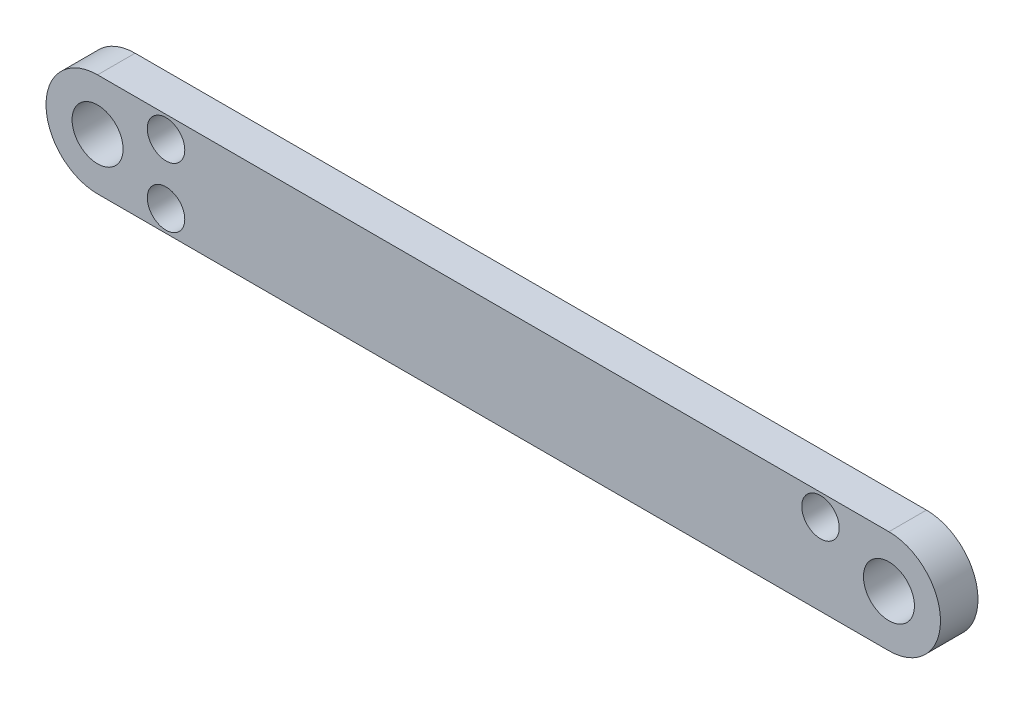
from build123d import *

# Parameters (mm, degrees)
BOSS_EXTRUDE1_DEPTH       = 2.54
F_4_CLEARANCE_HOLE1_D     = 3.4544
F_4_CLEARANCE_HOLE1_DEPTH = 6.35
F_4_CLEARANCE_HOLE1_TIP   = 1.037806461
SKETCH4_R                 = 1.27
CUT_EXTRUDE1_DEPTH        = 31.595799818


with BuildPart() as part:
    # Sketch1 → Boss-Extrude1 (new body)
    with BuildSketch(Plane.XY):
        with BuildLine():
            Line((-26.797, 3.4925), (26.797, 3.4925))
            ThreePointArc((26.797, 3.4925), (30.2895, 0), (26.797, -3.4925))
            Line((26.797, -3.4925), (-26.797, -3.4925))
            ThreePointArc((-26.797, -3.4925), (-30.2895, 0), (-26.797, 3.4925))
        make_face()
    extrude(amount=BOSS_EXTRUDE1_DEPTH)

    # 4 Clearance Hole1
    with Locations(Plane.XY.offset(2.54)):
        with Locations((-26.797, 0), (26.797, 0)):
            Hole(F_4_CLEARANCE_HOLE1_D / 2, depth=F_4_CLEARANCE_HOLE1_DEPTH)
            with Locations((0, 0, -(F_4_CLEARANCE_HOLE1_DEPTH + F_4_CLEARANCE_HOLE1_TIP / 2))):  # 118° drill point
                Cone(0, F_4_CLEARANCE_HOLE1_D / 2, F_4_CLEARANCE_HOLE1_TIP, mode=Mode.SUBTRACT)

    # Sketch4 → Cut-Extrude1 (cut, through all)
    with BuildSketch(Plane.XY.offset(2.54)):
        with Locations((22.1615, 2.032)):
            Circle(SKETCH4_R)
        with Locations((-22.1615, -2.032)):
            Circle(SKETCH4_R)
        with Locations((-22.1615, 2.032)):
            Circle(SKETCH4_R)
    extrude(amount=-CUT_EXTRUDE1_DEPTH, mode=Mode.SUBTRACT)


solid = part.part
